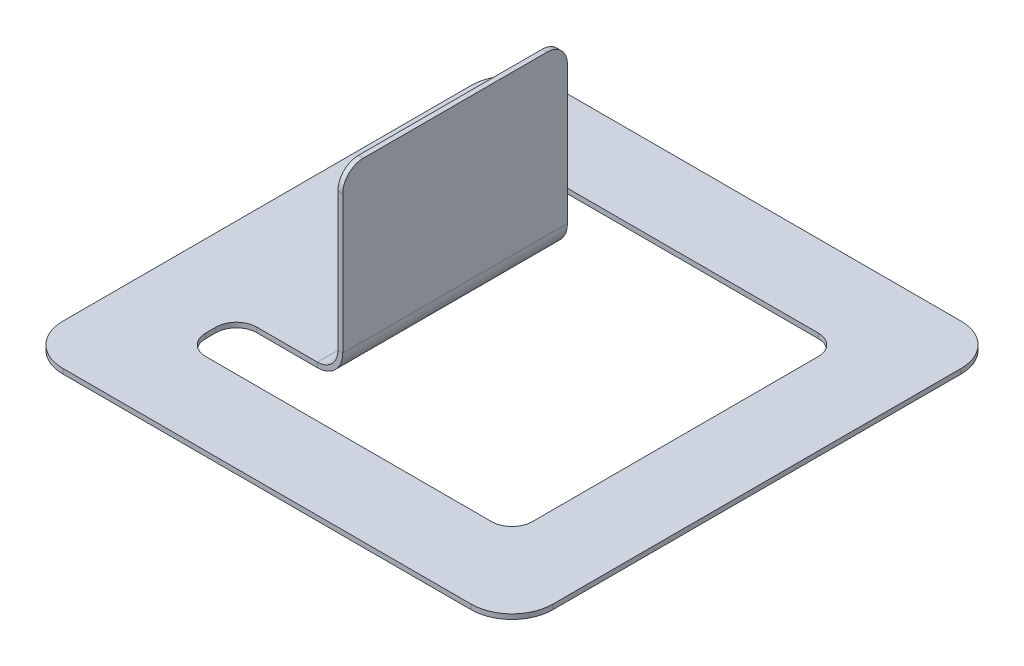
ISO-10303-21;
HEADER;
FILE_DESCRIPTION(('STEP AP214'),'2;1');
FILE_NAME('part.step','',(''),(''),'','','');
FILE_SCHEMA(('AUTOMOTIVE_DESIGN { 1 0 10303 214 1 1 1 1 }'));
ENDSEC;
DATA;
#1=APPLICATION_CONTEXT('core data for automotive mechanical design processes');
#2=APPLICATION_PROTOCOL_DEFINITION('international standard','automotive_design',2000,#1);
#3=PRODUCT_CONTEXT('',#1,'mechanical');
#4=PRODUCT('Part','Part','',(#3));
#5=PRODUCT_RELATED_PRODUCT_CATEGORY('part','',(#4));
#6=PRODUCT_DEFINITION_FORMATION('','',#4);
#7=PRODUCT_DEFINITION_CONTEXT('part definition',#1,'design');
#8=PRODUCT_DEFINITION('design','',#6,#7);
#9=PRODUCT_DEFINITION_SHAPE('','',#8);
#10=(LENGTH_UNIT() NAMED_UNIT(*) SI_UNIT(.MILLI.,.METRE.));
#11=(NAMED_UNIT(*) PLANE_ANGLE_UNIT() SI_UNIT($,.RADIAN.));
#12=(NAMED_UNIT(*) SI_UNIT($,.STERADIAN.) SOLID_ANGLE_UNIT());
#13=UNCERTAINTY_MEASURE_WITH_UNIT(LENGTH_MEASURE(1.E-05),#10,'distance_accuracy_value','');
#14=(GEOMETRIC_REPRESENTATION_CONTEXT(3) GLOBAL_UNCERTAINTY_ASSIGNED_CONTEXT((#13)) GLOBAL_UNIT_ASSIGNED_CONTEXT((#10,
#11,#12)) REPRESENTATION_CONTEXT('',''));
#15=CARTESIAN_POINT('',(0.,0.,0.));
#16=DIRECTION('',(0.,0.,1.));
#17=DIRECTION('',(1.,0.,0.));
#18=AXIS2_PLACEMENT_3D('',#15,#16,#17);
#19=CARTESIAN_POINT('',(-19.22749174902,85.7799882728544,-63.5));
#20=DIRECTION('',(1.,0.,0.));
#21=DIRECTION('',(0.,0.,-1.));
#22=AXIS2_PLACEMENT_3D('',#19,#20,#21);
#23=PLANE('',#22);
#24=DIRECTION('',(0.,1.,0.));
#25=VECTOR('',#24,1.);
#26=CARTESIAN_POINT('',(-19.2274917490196,-22.1700117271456,-34.9250000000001));
#27=LINE('',#26,#25);
#28=CARTESIAN_POINT('',(-19.2274917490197,7.87400000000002,-34.9250000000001));
#29=VERTEX_POINT('',#28);
#30=CARTESIAN_POINT('',(-19.2274917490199,50.8549882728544,-34.9250000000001));
#31=VERTEX_POINT('',#30);
#32=EDGE_CURVE('E36',#29,#31,#27,.T.);
#33=ORIENTED_EDGE('',*,*,#32,.F.);
#34=DIRECTION('',(0.,0.,1.));
#35=VECTOR('',#34,1.);
#36=CARTESIAN_POINT('',(-19.2274917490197,7.87400000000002,-63.5));
#37=LINE('',#36,#35);
#38=CARTESIAN_POINT('',(-19.2274917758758,7.87400000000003,34.925));
#39=VERTEX_POINT('',#38);
#40=EDGE_CURVE('E398',#29,#39,#37,.T.);
#41=ORIENTED_EDGE('',*,*,#40,.T.);
#42=DIRECTION('',(0.,-1.,0.));
#43=VECTOR('',#42,1.);
#44=CARTESIAN_POINT('',(-19.2274917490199,50.8549882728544,34.925));
#45=LINE('',#44,#43);
#46=CARTESIAN_POINT('',(-19.2274917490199,50.8549882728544,34.925));
#47=VERTEX_POINT('',#46);
#48=EDGE_CURVE('E382',#47,#39,#45,.T.);
#49=ORIENTED_EDGE('',*,*,#48,.F.);
#50=CARTESIAN_POINT('',(-19.2274917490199,50.8549882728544,28.575));
#51=DIRECTION('',(1.,0.,0.));
#52=DIRECTION('',(0.,0.,-1.));
#53=AXIS2_PLACEMENT_3D('',#50,#51,#52);
#54=CIRCLE('',#53,6.35);
#55=CARTESIAN_POINT('',(-19.2274917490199,57.2049882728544,28.575));
#56=VERTEX_POINT('',#55);
#57=EDGE_CURVE('E380',#56,#47,#54,.T.);
#58=ORIENTED_EDGE('',*,*,#57,.F.);
#59=DIRECTION('',(0.,0.,1.));
#60=VECTOR('',#59,1.);
#61=CARTESIAN_POINT('',(-19.2274917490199,57.2049882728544,-28.575));
#62=LINE('',#61,#60);
#63=CARTESIAN_POINT('',(-19.2274917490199,57.2049882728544,-28.575));
#64=VERTEX_POINT('',#63);
#65=EDGE_CURVE('E386',#64,#56,#62,.T.);
#66=ORIENTED_EDGE('',*,*,#65,.F.);
#67=CARTESIAN_POINT('',(-19.2274917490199,50.8549882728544,-28.5750000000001));
#68=DIRECTION('',(1.,0.,0.));
#69=DIRECTION('',(0.,0.,-1.));
#70=AXIS2_PLACEMENT_3D('',#67,#68,#69);
#71=CIRCLE('',#70,6.35);
#72=EDGE_CURVE('E383',#31,#64,#71,.T.);
#73=ORIENTED_EDGE('',*,*,#72,.F.);
#74=EDGE_LOOP('',(#33,#41,#49,#58,#66,#73));
#75=FACE_BOUND('',#74,.T.);
#76=ADVANCED_FACE('F32',(#75),#23,.F.);
#77=CARTESIAN_POINT('',(-17.70349174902,85.7799882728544,-63.5));
#78=DIRECTION('',(1.,0.,0.));
#79=DIRECTION('',(0.,0.,-1.));
#80=AXIS2_PLACEMENT_3D('',#77,#78,#79);
#81=PLANE('',#80);
#82=DIRECTION('',(0.,0.,1.));
#83=VECTOR('',#82,1.);
#84=CARTESIAN_POINT('',(-17.7034917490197,7.87400000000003,-63.5));
#85=LINE('',#84,#83);
#86=CARTESIAN_POINT('',(-17.7034917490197,7.87400000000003,-34.9250000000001));
#87=VERTEX_POINT('',#86);
#88=CARTESIAN_POINT('',(-17.7034917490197,7.87400000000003,34.925));
#89=VERTEX_POINT('',#88);
#90=EDGE_CURVE('E41',#87,#89,#85,.T.);
#91=ORIENTED_EDGE('',*,*,#90,.F.);
#92=DIRECTION('',(0.,1.,0.));
#93=VECTOR('',#92,1.);
#94=CARTESIAN_POINT('',(-17.7034917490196,-22.1700117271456,-34.9250000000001));
#95=LINE('',#94,#93);
#96=CARTESIAN_POINT('',(-17.7034917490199,50.8549882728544,-34.9250000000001));
#97=VERTEX_POINT('',#96);
#98=EDGE_CURVE('E57',#87,#97,#95,.T.);
#99=ORIENTED_EDGE('',*,*,#98,.T.);
#100=CARTESIAN_POINT('',(-17.7034917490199,50.8549882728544,-28.5750000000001));
#101=DIRECTION('',(1.,0.,0.));
#102=DIRECTION('',(0.,0.,-1.));
#103=AXIS2_PLACEMENT_3D('',#100,#101,#102);
#104=CIRCLE('',#103,6.35);
#105=CARTESIAN_POINT('',(-17.7034917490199,57.2049882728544,-28.575));
#106=VERTEX_POINT('',#105);
#107=EDGE_CURVE('E374',#97,#106,#104,.T.);
#108=ORIENTED_EDGE('',*,*,#107,.T.);
#109=DIRECTION('',(0.,0.,1.));
#110=VECTOR('',#109,1.);
#111=CARTESIAN_POINT('',(-17.7034917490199,57.2049882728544,-28.575));
#112=LINE('',#111,#110);
#113=CARTESIAN_POINT('',(-17.7034917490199,57.2049882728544,28.575));
#114=VERTEX_POINT('',#113);
#115=EDGE_CURVE('E377',#106,#114,#112,.T.);
#116=ORIENTED_EDGE('',*,*,#115,.T.);
#117=CARTESIAN_POINT('',(-17.7034917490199,50.8549882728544,28.575));
#118=DIRECTION('',(1.,0.,0.));
#119=DIRECTION('',(0.,0.,-1.));
#120=AXIS2_PLACEMENT_3D('',#117,#118,#119);
#121=CIRCLE('',#120,6.35);
#122=CARTESIAN_POINT('',(-17.7034917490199,50.8549882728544,34.925));
#123=VERTEX_POINT('',#122);
#124=EDGE_CURVE('E372',#114,#123,#121,.T.);
#125=ORIENTED_EDGE('',*,*,#124,.T.);
#126=DIRECTION('',(0.,-1.,0.));
#127=VECTOR('',#126,1.);
#128=CARTESIAN_POINT('',(-17.7034917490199,50.8549882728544,34.925));
#129=LINE('',#128,#127);
#130=EDGE_CURVE('E49',#123,#89,#129,.T.);
#131=ORIENTED_EDGE('',*,*,#130,.T.);
#132=EDGE_LOOP('',(#91,#99,#108,#116,#125,#131));
#133=FACE_BOUND('',#132,.T.);
#134=ADVANCED_FACE('F406',(#133),#81,.T.);
#135=CARTESIAN_POINT('',(-19.2274917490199,50.8549882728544,28.575));
#136=DIRECTION('',(1.,0.,0.));
#137=DIRECTION('',(0.,0.,-1.));
#138=AXIS2_PLACEMENT_3D('',#135,#136,#137);
#139=CYLINDRICAL_SURFACE('',#138,6.35);
#140=ORIENTED_EDGE('',*,*,#124,.F.);
#141=DIRECTION('',(1.,0.,0.));
#142=VECTOR('',#141,1.);
#143=CARTESIAN_POINT('',(-19.2274917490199,57.2049882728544,28.575));
#144=LINE('',#143,#142);
#145=EDGE_CURVE('E388',#56,#114,#144,.T.);
#146=ORIENTED_EDGE('',*,*,#145,.F.);
#147=ORIENTED_EDGE('',*,*,#57,.T.);
#148=DIRECTION('',(1.,0.,0.));
#149=VECTOR('',#148,1.);
#150=CARTESIAN_POINT('',(-19.2274917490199,50.8549882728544,34.925));
#151=LINE('',#150,#149);
#152=EDGE_CURVE('E395',#47,#123,#151,.T.);
#153=ORIENTED_EDGE('',*,*,#152,.T.);
#154=EDGE_LOOP('',(#140,#146,#147,#153));
#155=FACE_BOUND('',#154,.T.);
#156=ADVANCED_FACE('F419',(#155),#139,.T.);
#157=CARTESIAN_POINT('',(-19.2274917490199,50.8549882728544,34.925));
#158=DIRECTION('',(0.,0.,1.));
#159=DIRECTION('',(0.,1.,0.));
#160=AXIS2_PLACEMENT_3D('',#157,#158,#159);
#161=PLANE('',#160);
#162=DIRECTION('',(-1.,0.,0.));
#163=VECTOR('',#162,1.);
#164=CARTESIAN_POINT('',(-19.2274917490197,7.87400000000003,34.925));
#165=LINE('',#164,#163);
#166=EDGE_CURVE('E12',#89,#39,#165,.T.);
#167=ORIENTED_EDGE('',*,*,#166,.F.);
#168=ORIENTED_EDGE('',*,*,#130,.F.);
#169=ORIENTED_EDGE('',*,*,#152,.F.);
#170=ORIENTED_EDGE('',*,*,#48,.T.);
#171=EDGE_LOOP('',(#167,#168,#169,#170));
#172=FACE_BOUND('',#171,.T.);
#173=ADVANCED_FACE('F34',(#172),#161,.T.);
#174=CARTESIAN_POINT('',(-19.2274917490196,-22.1700117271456,-34.9250000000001));
#175=DIRECTION('',(0.,0.,-1.));
#176=DIRECTION('',(0.,-1.,0.));
#177=AXIS2_PLACEMENT_3D('',#174,#175,#176);
#178=PLANE('',#177);
#179=DIRECTION('',(1.,0.,0.));
#180=VECTOR('',#179,1.);
#181=CARTESIAN_POINT('',(-19.2274917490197,7.87400000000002,-34.9250000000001));
#182=LINE('',#181,#180);
#183=EDGE_CURVE('E401',#29,#87,#182,.T.);
#184=ORIENTED_EDGE('',*,*,#183,.F.);
#185=ORIENTED_EDGE('',*,*,#32,.T.);
#186=DIRECTION('',(1.,0.,0.));
#187=VECTOR('',#186,1.);
#188=CARTESIAN_POINT('',(-19.2274917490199,50.8549882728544,-34.9250000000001));
#189=LINE('',#188,#187);
#190=EDGE_CURVE('E393',#31,#97,#189,.T.);
#191=ORIENTED_EDGE('',*,*,#190,.T.);
#192=ORIENTED_EDGE('',*,*,#98,.F.);
#193=EDGE_LOOP('',(#184,#185,#191,#192));
#194=FACE_BOUND('',#193,.T.);
#195=ADVANCED_FACE('F409',(#194),#178,.T.);
#196=CARTESIAN_POINT('',(-19.2274917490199,50.8549882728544,-28.5750000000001));
#197=DIRECTION('',(1.,0.,0.));
#198=DIRECTION('',(0.,0.,-1.));
#199=AXIS2_PLACEMENT_3D('',#196,#197,#198);
#200=CYLINDRICAL_SURFACE('',#199,6.35);
#201=ORIENTED_EDGE('',*,*,#107,.F.);
#202=ORIENTED_EDGE('',*,*,#190,.F.);
#203=ORIENTED_EDGE('',*,*,#72,.T.);
#204=DIRECTION('',(1.,0.,0.));
#205=VECTOR('',#204,1.);
#206=CARTESIAN_POINT('',(-19.2274917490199,57.2049882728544,-28.575));
#207=LINE('',#206,#205);
#208=EDGE_CURVE('E391',#64,#106,#207,.T.);
#209=ORIENTED_EDGE('',*,*,#208,.T.);
#210=EDGE_LOOP('',(#201,#202,#203,#209));
#211=FACE_BOUND('',#210,.T.);
#212=ADVANCED_FACE('F412',(#211),#200,.T.);
#213=CARTESIAN_POINT('',(-19.2274917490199,57.2049882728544,-28.575));
#214=DIRECTION('',(0.,1.,0.));
#215=DIRECTION('',(0.,0.,-1.));
#216=AXIS2_PLACEMENT_3D('',#213,#214,#215);
#217=PLANE('',#216);
#218=ORIENTED_EDGE('',*,*,#115,.F.);
#219=ORIENTED_EDGE('',*,*,#208,.F.);
#220=ORIENTED_EDGE('',*,*,#65,.T.);
#221=ORIENTED_EDGE('',*,*,#145,.T.);
#222=EDGE_LOOP('',(#218,#219,#220,#221));
#223=FACE_BOUND('',#222,.T.);
#224=ADVANCED_FACE('F416',(#223),#217,.T.);
#225=CARTESIAN_POINT('',(76.2,1.524,-63.5));
#226=DIRECTION('',(-1.,0.,0.));
#227=DIRECTION('',(0.,0.,1.));
#228=AXIS2_PLACEMENT_3D('',#225,#226,#227);
#229=PLANE('',#228);
#230=DIRECTION('',(0.,0.,-1.));
#231=VECTOR('',#230,1.);
#232=CARTESIAN_POINT('',(76.2,0.,-63.5));
#233=LINE('',#232,#231);
#234=CARTESIAN_POINT('',(76.2,0.,63.5));
#235=VERTEX_POINT('',#234);
#236=CARTESIAN_POINT('',(76.2,0.,-63.5));
#237=VERTEX_POINT('',#236);
#238=EDGE_CURVE('E368',#235,#237,#233,.T.);
#239=ORIENTED_EDGE('',*,*,#238,.T.);
#240=DIRECTION('',(0.,-1.,0.));
#241=VECTOR('',#240,1.);
#242=CARTESIAN_POINT('',(76.2,1.524,-63.5));
#243=LINE('',#242,#241);
#244=CARTESIAN_POINT('',(76.2,1.524,-63.5));
#245=VERTEX_POINT('',#244);
#246=EDGE_CURVE('E329',#245,#237,#243,.T.);
#247=ORIENTED_EDGE('',*,*,#246,.F.);
#248=DIRECTION('',(0.,0.,-1.));
#249=VECTOR('',#248,1.);
#250=CARTESIAN_POINT('',(76.2,1.524,-63.5));
#251=LINE('',#250,#249);
#252=CARTESIAN_POINT('',(76.2,1.524,63.5));
#253=VERTEX_POINT('',#252);
#254=EDGE_CURVE('E268',#253,#245,#251,.T.);
#255=ORIENTED_EDGE('',*,*,#254,.F.);
#256=DIRECTION('',(0.,-1.,0.));
#257=VECTOR('',#256,1.);
#258=CARTESIAN_POINT('',(76.2,1.524,63.5));
#259=LINE('',#258,#257);
#260=EDGE_CURVE('E365',#253,#235,#259,.T.);
#261=ORIENTED_EDGE('',*,*,#260,.T.);
#262=EDGE_LOOP('',(#239,#247,#255,#261));
#263=FACE_BOUND('',#262,.T.);
#264=ADVANCED_FACE('F565',(#263),#229,.F.);
#265=CARTESIAN_POINT('',(63.5,1.524,63.5));
#266=DIRECTION('',(0.,-1.,0.));
#267=DIRECTION('',(0.,0.,-1.));
#268=AXIS2_PLACEMENT_3D('',#265,#266,#267);
#269=CYLINDRICAL_SURFACE('',#268,12.7);
#270=CARTESIAN_POINT('',(63.5,0.,63.5));
#271=DIRECTION('',(0.,1.,0.));
#272=DIRECTION('',(0.,0.,1.));
#273=AXIS2_PLACEMENT_3D('',#270,#271,#272);
#274=CIRCLE('',#273,12.7);
#275=CARTESIAN_POINT('',(63.5,0.,76.2));
#276=VERTEX_POINT('',#275);
#277=EDGE_CURVE('E363',#276,#235,#274,.T.);
#278=ORIENTED_EDGE('',*,*,#277,.T.);
#279=ORIENTED_EDGE('',*,*,#260,.F.);
#280=CARTESIAN_POINT('',(63.5,1.524,63.5));
#281=DIRECTION('',(0.,1.,0.));
#282=DIRECTION('',(0.,0.,1.));
#283=AXIS2_PLACEMENT_3D('',#280,#281,#282);
#284=CIRCLE('',#283,12.7);
#285=CARTESIAN_POINT('',(63.5,1.524,76.2));
#286=VERTEX_POINT('',#285);
#287=EDGE_CURVE('E270',#286,#253,#284,.T.);
#288=ORIENTED_EDGE('',*,*,#287,.F.);
#289=DIRECTION('',(0.,-1.,0.));
#290=VECTOR('',#289,1.);
#291=CARTESIAN_POINT('',(63.5,1.524,76.2));
#292=LINE('',#291,#290);
#293=EDGE_CURVE('E360',#286,#276,#292,.T.);
#294=ORIENTED_EDGE('',*,*,#293,.T.);
#295=EDGE_LOOP('',(#278,#279,#288,#294));
#296=FACE_BOUND('',#295,.T.);
#297=ADVANCED_FACE('F561',(#296),#269,.T.);
#298=CARTESIAN_POINT('',(-63.5,1.524,76.2));
#299=DIRECTION('',(0.,0.,-1.));
#300=DIRECTION('',(-1.,0.,0.));
#301=AXIS2_PLACEMENT_3D('',#298,#299,#300);
#302=PLANE('',#301);
#303=DIRECTION('',(1.,0.,0.));
#304=VECTOR('',#303,1.);
#305=CARTESIAN_POINT('',(-63.5,0.,76.2));
#306=LINE('',#305,#304);
#307=CARTESIAN_POINT('',(-63.5,0.,76.2));
#308=VERTEX_POINT('',#307);
#309=EDGE_CURVE('E358',#308,#276,#306,.T.);
#310=ORIENTED_EDGE('',*,*,#309,.T.);
#311=ORIENTED_EDGE('',*,*,#293,.F.);
#312=DIRECTION('',(1.,0.,0.));
#313=VECTOR('',#312,1.);
#314=CARTESIAN_POINT('',(-63.5,1.524,76.2));
#315=LINE('',#314,#313);
#316=CARTESIAN_POINT('',(-63.5,1.524,76.2));
#317=VERTEX_POINT('',#316);
#318=EDGE_CURVE('E272',#317,#286,#315,.T.);
#319=ORIENTED_EDGE('',*,*,#318,.F.);
#320=DIRECTION('',(0.,-1.,0.));
#321=VECTOR('',#320,1.);
#322=CARTESIAN_POINT('',(-63.5,1.524,76.2));
#323=LINE('',#322,#321);
#324=EDGE_CURVE('E355',#317,#308,#323,.T.);
#325=ORIENTED_EDGE('',*,*,#324,.T.);
#326=EDGE_LOOP('',(#310,#311,#319,#325));
#327=FACE_BOUND('',#326,.T.);
#328=ADVANCED_FACE('F557',(#327),#302,.F.);
#329=CARTESIAN_POINT('',(-63.5,1.524,63.5));
#330=DIRECTION('',(0.,-1.,0.));
#331=DIRECTION('',(0.,0.,-1.));
#332=AXIS2_PLACEMENT_3D('',#329,#330,#331);
#333=CYLINDRICAL_SURFACE('',#332,12.7);
#334=CARTESIAN_POINT('',(-63.5,0.,63.5));
#335=DIRECTION('',(0.,1.,0.));
#336=DIRECTION('',(0.,0.,1.));
#337=AXIS2_PLACEMENT_3D('',#334,#335,#336);
#338=CIRCLE('',#337,12.7);
#339=CARTESIAN_POINT('',(-76.2,0.,63.5));
#340=VERTEX_POINT('',#339);
#341=EDGE_CURVE('E353',#340,#308,#338,.T.);
#342=ORIENTED_EDGE('',*,*,#341,.T.);
#343=ORIENTED_EDGE('',*,*,#324,.F.);
#344=CARTESIAN_POINT('',(-63.5,1.524,63.5));
#345=DIRECTION('',(0.,1.,0.));
#346=DIRECTION('',(0.,0.,1.));
#347=AXIS2_PLACEMENT_3D('',#344,#345,#346);
#348=CIRCLE('',#347,12.7);
#349=CARTESIAN_POINT('',(-76.2,1.524,63.5));
#350=VERTEX_POINT('',#349);
#351=EDGE_CURVE('E274',#350,#317,#348,.T.);
#352=ORIENTED_EDGE('',*,*,#351,.F.);
#353=DIRECTION('',(0.,-1.,0.));
#354=VECTOR('',#353,1.);
#355=CARTESIAN_POINT('',(-76.2,1.524,63.5));
#356=LINE('',#355,#354);
#357=EDGE_CURVE('E350',#350,#340,#356,.T.);
#358=ORIENTED_EDGE('',*,*,#357,.T.);
#359=EDGE_LOOP('',(#342,#343,#352,#358));
#360=FACE_BOUND('',#359,.T.);
#361=ADVANCED_FACE('F552',(#360),#333,.T.);
#362=CARTESIAN_POINT('',(-76.2,1.524,-63.5));
#363=DIRECTION('',(1.,0.,0.));
#364=DIRECTION('',(0.,0.,-1.));
#365=AXIS2_PLACEMENT_3D('',#362,#363,#364);
#366=PLANE('',#365);
#367=DIRECTION('',(0.,0.,1.));
#368=VECTOR('',#367,1.);
#369=CARTESIAN_POINT('',(-76.2,0.,-63.5));
#370=LINE('',#369,#368);
#371=CARTESIAN_POINT('',(-76.2,0.,-63.5));
#372=VERTEX_POINT('',#371);
#373=EDGE_CURVE('E348',#372,#340,#370,.T.);
#374=ORIENTED_EDGE('',*,*,#373,.T.);
#375=ORIENTED_EDGE('',*,*,#357,.F.);
#376=DIRECTION('',(0.,0.,1.));
#377=VECTOR('',#376,1.);
#378=CARTESIAN_POINT('',(-76.2,1.524,-63.5));
#379=LINE('',#378,#377);
#380=CARTESIAN_POINT('',(-76.2,1.524,-63.5));
#381=VERTEX_POINT('',#380);
#382=EDGE_CURVE('E276',#381,#350,#379,.T.);
#383=ORIENTED_EDGE('',*,*,#382,.F.);
#384=DIRECTION('',(0.,-1.,0.));
#385=VECTOR('',#384,1.);
#386=CARTESIAN_POINT('',(-76.2,1.524,-63.5));
#387=LINE('',#386,#385);
#388=EDGE_CURVE('E345',#381,#372,#387,.T.);
#389=ORIENTED_EDGE('',*,*,#388,.T.);
#390=EDGE_LOOP('',(#374,#375,#383,#389));
#391=FACE_BOUND('',#390,.T.);
#392=ADVANCED_FACE('F548',(#391),#366,.F.);
#393=CARTESIAN_POINT('',(-63.5,1.524,-63.5));
#394=DIRECTION('',(0.,-1.,0.));
#395=DIRECTION('',(0.,0.,-1.));
#396=AXIS2_PLACEMENT_3D('',#393,#394,#395);
#397=CYLINDRICAL_SURFACE('',#396,12.7);
#398=CARTESIAN_POINT('',(-63.5,0.,-63.5));
#399=DIRECTION('',(0.,1.,0.));
#400=DIRECTION('',(0.,0.,1.));
#401=AXIS2_PLACEMENT_3D('',#398,#399,#400);
#402=CIRCLE('',#401,12.7);
#403=CARTESIAN_POINT('',(-63.5,0.,-76.2));
#404=VERTEX_POINT('',#403);
#405=EDGE_CURVE('E343',#404,#372,#402,.T.);
#406=ORIENTED_EDGE('',*,*,#405,.T.);
#407=ORIENTED_EDGE('',*,*,#388,.F.);
#408=CARTESIAN_POINT('',(-63.5,1.524,-63.5));
#409=DIRECTION('',(0.,1.,0.));
#410=DIRECTION('',(0.,0.,1.));
#411=AXIS2_PLACEMENT_3D('',#408,#409,#410);
#412=CIRCLE('',#411,12.7);
#413=CARTESIAN_POINT('',(-63.5,1.524,-76.2));
#414=VERTEX_POINT('',#413);
#415=EDGE_CURVE('E278',#414,#381,#412,.T.);
#416=ORIENTED_EDGE('',*,*,#415,.F.);
#417=DIRECTION('',(0.,-1.,0.));
#418=VECTOR('',#417,1.);
#419=CARTESIAN_POINT('',(-63.5,1.524,-76.2));
#420=LINE('',#419,#418);
#421=EDGE_CURVE('E340',#414,#404,#420,.T.);
#422=ORIENTED_EDGE('',*,*,#421,.T.);
#423=EDGE_LOOP('',(#406,#407,#416,#422));
#424=FACE_BOUND('',#423,.T.);
#425=ADVANCED_FACE('F542',(#424),#397,.T.);
#426=CARTESIAN_POINT('',(-63.5,1.524,-76.2));
#427=DIRECTION('',(0.,0.,1.));
#428=DIRECTION('',(1.,0.,0.));
#429=AXIS2_PLACEMENT_3D('',#426,#427,#428);
#430=PLANE('',#429);
#431=DIRECTION('',(-1.,0.,0.));
#432=VECTOR('',#431,1.);
#433=CARTESIAN_POINT('',(-63.5,0.,-76.2));
#434=LINE('',#433,#432);
#435=CARTESIAN_POINT('',(63.5,0.,-76.2));
#436=VERTEX_POINT('',#435);
#437=EDGE_CURVE('E338',#436,#404,#434,.T.);
#438=ORIENTED_EDGE('',*,*,#437,.T.);
#439=ORIENTED_EDGE('',*,*,#421,.F.);
#440=DIRECTION('',(-1.,0.,0.));
#441=VECTOR('',#440,1.);
#442=CARTESIAN_POINT('',(-63.5,1.524,-76.2));
#443=LINE('',#442,#441);
#444=CARTESIAN_POINT('',(63.5,1.524,-76.2));
#445=VERTEX_POINT('',#444);
#446=EDGE_CURVE('E280',#445,#414,#443,.T.);
#447=ORIENTED_EDGE('',*,*,#446,.F.);
#448=DIRECTION('',(0.,-1.,0.));
#449=VECTOR('',#448,1.);
#450=CARTESIAN_POINT('',(63.5,1.524,-76.2));
#451=LINE('',#450,#449);
#452=EDGE_CURVE('E335',#445,#436,#451,.T.);
#453=ORIENTED_EDGE('',*,*,#452,.T.);
#454=EDGE_LOOP('',(#438,#439,#447,#453));
#455=FACE_BOUND('',#454,.T.);
#456=ADVANCED_FACE('F537',(#455),#430,.F.);
#457=CARTESIAN_POINT('',(63.5,1.524,-63.5));
#458=DIRECTION('',(0.,-1.,0.));
#459=DIRECTION('',(0.,0.,-1.));
#460=AXIS2_PLACEMENT_3D('',#457,#458,#459);
#461=CYLINDRICAL_SURFACE('',#460,12.7);
#462=CARTESIAN_POINT('',(63.5,0.,-63.5));
#463=DIRECTION('',(0.,1.,0.));
#464=DIRECTION('',(0.,0.,-1.));
#465=AXIS2_PLACEMENT_3D('',#462,#463,#464);
#466=CIRCLE('',#465,12.7);
#467=EDGE_CURVE('E332',#237,#436,#466,.T.);
#468=ORIENTED_EDGE('',*,*,#467,.T.);
#469=ORIENTED_EDGE('',*,*,#452,.F.);
#470=CARTESIAN_POINT('',(63.5,1.524,-63.5));
#471=DIRECTION('',(0.,1.,0.));
#472=DIRECTION('',(0.,0.,-1.));
#473=AXIS2_PLACEMENT_3D('',#470,#471,#472);
#474=CIRCLE('',#473,12.7);
#475=EDGE_CURVE('E282',#245,#445,#474,.T.);
#476=ORIENTED_EDGE('',*,*,#475,.F.);
#477=ORIENTED_EDGE('',*,*,#246,.T.);
#478=EDGE_LOOP('',(#468,#469,#476,#477));
#479=FACE_BOUND('',#478,.T.);
#480=ADVANCED_FACE('F534',(#479),#461,.T.);
#481=CARTESIAN_POINT('',(-44.45,1.524,41.275));
#482=DIRECTION('',(0.,-1.,0.));
#483=DIRECTION('',(0.,0.,-1.));
#484=AXIS2_PLACEMENT_3D('',#481,#482,#483);
#485=CYLINDRICAL_SURFACE('',#484,6.35000000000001);
#486=CARTESIAN_POINT('',(-44.45,0.,41.275));
#487=DIRECTION('',(0.,1.,0.));
#488=DIRECTION('',(0.,0.,-1.));
#489=AXIS2_PLACEMENT_3D('',#486,#487,#488);
#490=CIRCLE('',#489,6.35000000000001);
#491=CARTESIAN_POINT('',(-44.45,0.,34.925));
#492=VERTEX_POINT('',#491);
#493=CARTESIAN_POINT('',(-50.8,0.,41.275));
#494=VERTEX_POINT('',#493);
#495=EDGE_CURVE('E252',#492,#494,#490,.T.);
#496=ORIENTED_EDGE('',*,*,#495,.F.);
#497=DIRECTION('',(0.,-1.,0.));
#498=VECTOR('',#497,1.);
#499=CARTESIAN_POINT('',(-44.45,1.524,34.925));
#500=LINE('',#499,#498);
#501=CARTESIAN_POINT('',(-44.45,1.524,34.925));
#502=VERTEX_POINT('',#501);
#503=EDGE_CURVE('E248',#502,#492,#500,.T.);
#504=ORIENTED_EDGE('',*,*,#503,.F.);
#505=CARTESIAN_POINT('',(-44.45,1.524,41.275));
#506=DIRECTION('',(0.,1.,0.));
#507=DIRECTION('',(0.,0.,-1.));
#508=AXIS2_PLACEMENT_3D('',#505,#506,#507);
#509=CIRCLE('',#508,6.35000000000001);
#510=CARTESIAN_POINT('',(-50.8,1.524,41.275));
#511=VERTEX_POINT('',#510);
#512=EDGE_CURVE('E327',#502,#511,#509,.T.);
#513=ORIENTED_EDGE('',*,*,#512,.T.);
#514=DIRECTION('',(0.,-1.,0.));
#515=VECTOR('',#514,1.);
#516=CARTESIAN_POINT('',(-50.8,1.524,41.275));
#517=LINE('',#516,#515);
#518=EDGE_CURVE('E325',#511,#494,#517,.T.);
#519=ORIENTED_EDGE('',*,*,#518,.T.);
#520=EDGE_LOOP('',(#496,#504,#513,#519));
#521=FACE_BOUND('',#520,.T.);
#522=ADVANCED_FACE('F465',(#521),#485,.F.);
#523=CARTESIAN_POINT('',(-50.8,1.524,41.275));
#524=DIRECTION('',(1.,0.,0.));
#525=DIRECTION('',(0.,0.,-1.));
#526=AXIS2_PLACEMENT_3D('',#523,#524,#525);
#527=PLANE('',#526);
#528=DIRECTION('',(0.,0.,1.));
#529=VECTOR('',#528,1.);
#530=CARTESIAN_POINT('',(-50.8,0.,41.275));
#531=LINE('',#530,#529);
#532=CARTESIAN_POINT('',(-50.7999999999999,0.,44.4500000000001));
#533=VERTEX_POINT('',#532);
#534=EDGE_CURVE('E461',#494,#533,#531,.T.);
#535=ORIENTED_EDGE('',*,*,#534,.F.);
#536=ORIENTED_EDGE('',*,*,#518,.F.);
#537=DIRECTION('',(0.,0.,1.));
#538=VECTOR('',#537,1.);
#539=CARTESIAN_POINT('',(-50.8,1.524,41.275));
#540=LINE('',#539,#538);
#541=CARTESIAN_POINT('',(-50.7999999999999,1.524,44.4500000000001));
#542=VERTEX_POINT('',#541);
#543=EDGE_CURVE('E323',#511,#542,#540,.T.);
#544=ORIENTED_EDGE('',*,*,#543,.T.);
#545=DIRECTION('',(0.,-1.,0.));
#546=VECTOR('',#545,1.);
#547=CARTESIAN_POINT('',(-50.7999999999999,1.524,44.4500000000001));
#548=LINE('',#547,#546);
#549=EDGE_CURVE('E321',#542,#533,#548,.T.);
#550=ORIENTED_EDGE('',*,*,#549,.T.);
#551=EDGE_LOOP('',(#535,#536,#544,#550));
#552=FACE_BOUND('',#551,.T.);
#553=ADVANCED_FACE('F470',(#552),#527,.T.);
#554=CARTESIAN_POINT('',(-44.4499999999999,1.524,44.4500000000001));
#555=DIRECTION('',(0.,-1.,0.));
#556=DIRECTION('',(0.,0.,-1.));
#557=AXIS2_PLACEMENT_3D('',#554,#555,#556);
#558=CYLINDRICAL_SURFACE('',#557,6.35);
#559=CARTESIAN_POINT('',(-44.4499999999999,0.,44.4500000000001));
#560=DIRECTION('',(0.,1.,0.));
#561=DIRECTION('',(0.,0.,1.));
#562=AXIS2_PLACEMENT_3D('',#559,#560,#561);
#563=CIRCLE('',#562,6.35);
#564=CARTESIAN_POINT('',(-44.4499999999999,0.,50.8000000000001));
#565=VERTEX_POINT('',#564);
#566=EDGE_CURVE('E458',#533,#565,#563,.T.);
#567=ORIENTED_EDGE('',*,*,#566,.F.);
#568=ORIENTED_EDGE('',*,*,#549,.F.);
#569=CARTESIAN_POINT('',(-44.4499999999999,1.524,44.4500000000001));
#570=DIRECTION('',(0.,1.,0.));
#571=DIRECTION('',(0.,0.,1.));
#572=AXIS2_PLACEMENT_3D('',#569,#570,#571);
#573=CIRCLE('',#572,6.35);
#574=CARTESIAN_POINT('',(-44.4499999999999,1.524,50.8000000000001));
#575=VERTEX_POINT('',#574);
#576=EDGE_CURVE('E319',#542,#575,#573,.T.);
#577=ORIENTED_EDGE('',*,*,#576,.T.);
#578=DIRECTION('',(0.,-1.,0.));
#579=VECTOR('',#578,1.);
#580=CARTESIAN_POINT('',(-44.4499999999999,1.524,50.8000000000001));
#581=LINE('',#580,#579);
#582=EDGE_CURVE('E317',#575,#565,#581,.T.);
#583=ORIENTED_EDGE('',*,*,#582,.T.);
#584=EDGE_LOOP('',(#567,#568,#577,#583));
#585=FACE_BOUND('',#584,.T.);
#586=ADVANCED_FACE('F475',(#585),#558,.F.);
#587=CARTESIAN_POINT('',(-44.4499999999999,1.524,50.8000000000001));
#588=DIRECTION('',(0.,0.,-1.));
#589=DIRECTION('',(-1.,0.,0.));
#590=AXIS2_PLACEMENT_3D('',#587,#588,#589);
#591=PLANE('',#590);
#592=DIRECTION('',(1.,0.,0.));
#593=VECTOR('',#592,1.);
#594=CARTESIAN_POINT('',(-44.4499999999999,0.,50.8000000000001));
#595=LINE('',#594,#593);
#596=CARTESIAN_POINT('',(44.4500000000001,0.,50.8000000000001));
#597=VERTEX_POINT('',#596);
#598=EDGE_CURVE('E455',#565,#597,#595,.T.);
#599=ORIENTED_EDGE('',*,*,#598,.F.);
#600=ORIENTED_EDGE('',*,*,#582,.F.);
#601=DIRECTION('',(1.,0.,0.));
#602=VECTOR('',#601,1.);
#603=CARTESIAN_POINT('',(-44.4499999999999,1.524,50.8000000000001));
#604=LINE('',#603,#602);
#605=CARTESIAN_POINT('',(44.4500000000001,1.524,50.8000000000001));
#606=VERTEX_POINT('',#605);
#607=EDGE_CURVE('E315',#575,#606,#604,.T.);
#608=ORIENTED_EDGE('',*,*,#607,.T.);
#609=DIRECTION('',(0.,-1.,0.));
#610=VECTOR('',#609,1.);
#611=CARTESIAN_POINT('',(44.4500000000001,1.524,50.8000000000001));
#612=LINE('',#611,#610);
#613=EDGE_CURVE('E313',#606,#597,#612,.T.);
#614=ORIENTED_EDGE('',*,*,#613,.T.);
#615=EDGE_LOOP('',(#599,#600,#608,#614));
#616=FACE_BOUND('',#615,.T.);
#617=ADVANCED_FACE('F480',(#616),#591,.T.);
#618=CARTESIAN_POINT('',(44.4500000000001,1.524,44.4500000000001));
#619=DIRECTION('',(0.,-1.,0.));
#620=DIRECTION('',(0.,0.,-1.));
#621=AXIS2_PLACEMENT_3D('',#618,#619,#620);
#622=CYLINDRICAL_SURFACE('',#621,6.35);
#623=CARTESIAN_POINT('',(44.4500000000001,0.,44.4500000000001));
#624=DIRECTION('',(0.,1.,0.));
#625=DIRECTION('',(0.,0.,-1.));
#626=AXIS2_PLACEMENT_3D('',#623,#624,#625);
#627=CIRCLE('',#626,6.35);
#628=CARTESIAN_POINT('',(50.8000000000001,0.,44.4500000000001));
#629=VERTEX_POINT('',#628);
#630=EDGE_CURVE('E452',#597,#629,#627,.T.);
#631=ORIENTED_EDGE('',*,*,#630,.F.);
#632=ORIENTED_EDGE('',*,*,#613,.F.);
#633=CARTESIAN_POINT('',(44.4500000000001,1.524,44.4500000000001));
#634=DIRECTION('',(0.,1.,0.));
#635=DIRECTION('',(0.,0.,-1.));
#636=AXIS2_PLACEMENT_3D('',#633,#634,#635);
#637=CIRCLE('',#636,6.35);
#638=CARTESIAN_POINT('',(50.8000000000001,1.524,44.4500000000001));
#639=VERTEX_POINT('',#638);
#640=EDGE_CURVE('E311',#606,#639,#637,.T.);
#641=ORIENTED_EDGE('',*,*,#640,.T.);
#642=DIRECTION('',(0.,-1.,0.));
#643=VECTOR('',#642,1.);
#644=CARTESIAN_POINT('',(50.8000000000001,1.524,44.4500000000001));
#645=LINE('',#644,#643);
#646=EDGE_CURVE('E309',#639,#629,#645,.T.);
#647=ORIENTED_EDGE('',*,*,#646,.T.);
#648=EDGE_LOOP('',(#631,#632,#641,#647));
#649=FACE_BOUND('',#648,.T.);
#650=ADVANCED_FACE('F485',(#649),#622,.F.);
#651=CARTESIAN_POINT('',(50.8000000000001,1.524,-44.4499999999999));
#652=DIRECTION('',(-1.,0.,0.));
#653=DIRECTION('',(0.,0.,1.));
#654=AXIS2_PLACEMENT_3D('',#651,#652,#653);
#655=PLANE('',#654);
#656=DIRECTION('',(0.,0.,-1.));
#657=VECTOR('',#656,1.);
#658=CARTESIAN_POINT('',(50.8000000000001,0.,-44.4499999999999));
#659=LINE('',#658,#657);
#660=CARTESIAN_POINT('',(50.8000000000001,0.,-44.4499999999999));
#661=VERTEX_POINT('',#660);
#662=EDGE_CURVE('E449',#629,#661,#659,.T.);
#663=ORIENTED_EDGE('',*,*,#662,.F.);
#664=ORIENTED_EDGE('',*,*,#646,.F.);
#665=DIRECTION('',(0.,0.,-1.));
#666=VECTOR('',#665,1.);
#667=CARTESIAN_POINT('',(50.8000000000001,1.524,-44.4499999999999));
#668=LINE('',#667,#666);
#669=CARTESIAN_POINT('',(50.8000000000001,1.524,-44.4499999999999));
#670=VERTEX_POINT('',#669);
#671=EDGE_CURVE('E307',#639,#670,#668,.T.);
#672=ORIENTED_EDGE('',*,*,#671,.T.);
#673=DIRECTION('',(0.,-1.,0.));
#674=VECTOR('',#673,1.);
#675=CARTESIAN_POINT('',(50.8000000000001,1.524,-44.4499999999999));
#676=LINE('',#675,#674);
#677=EDGE_CURVE('E305',#670,#661,#676,.T.);
#678=ORIENTED_EDGE('',*,*,#677,.T.);
#679=EDGE_LOOP('',(#663,#664,#672,#678));
#680=FACE_BOUND('',#679,.T.);
#681=ADVANCED_FACE('F490',(#680),#655,.T.);
#682=CARTESIAN_POINT('',(44.4500000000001,1.524,-44.4499999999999));
#683=DIRECTION('',(0.,-1.,0.));
#684=DIRECTION('',(0.,0.,-1.));
#685=AXIS2_PLACEMENT_3D('',#682,#683,#684);
#686=CYLINDRICAL_SURFACE('',#685,6.35);
#687=CARTESIAN_POINT('',(44.4500000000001,0.,-44.4499999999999));
#688=DIRECTION('',(0.,1.,0.));
#689=DIRECTION('',(0.,0.,-1.));
#690=AXIS2_PLACEMENT_3D('',#687,#688,#689);
#691=CIRCLE('',#690,6.35);
#692=CARTESIAN_POINT('',(44.4500000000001,0.,-50.7999999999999));
#693=VERTEX_POINT('',#692);
#694=EDGE_CURVE('E446',#661,#693,#691,.T.);
#695=ORIENTED_EDGE('',*,*,#694,.F.);
#696=ORIENTED_EDGE('',*,*,#677,.F.);
#697=CARTESIAN_POINT('',(44.4500000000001,1.524,-44.4499999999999));
#698=DIRECTION('',(0.,1.,0.));
#699=DIRECTION('',(0.,0.,-1.));
#700=AXIS2_PLACEMENT_3D('',#697,#698,#699);
#701=CIRCLE('',#700,6.35);
#702=CARTESIAN_POINT('',(44.4500000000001,1.524,-50.7999999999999));
#703=VERTEX_POINT('',#702);
#704=EDGE_CURVE('E303',#670,#703,#701,.T.);
#705=ORIENTED_EDGE('',*,*,#704,.T.);
#706=DIRECTION('',(0.,-1.,0.));
#707=VECTOR('',#706,1.);
#708=CARTESIAN_POINT('',(44.4500000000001,1.524,-50.7999999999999));
#709=LINE('',#708,#707);
#710=EDGE_CURVE('E301',#703,#693,#709,.T.);
#711=ORIENTED_EDGE('',*,*,#710,.T.);
#712=EDGE_LOOP('',(#695,#696,#705,#711));
#713=FACE_BOUND('',#712,.T.);
#714=ADVANCED_FACE('F495',(#713),#686,.F.);
#715=CARTESIAN_POINT('',(-44.4499999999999,1.524,-50.7999999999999));
#716=DIRECTION('',(0.,0.,1.));
#717=DIRECTION('',(1.,0.,0.));
#718=AXIS2_PLACEMENT_3D('',#715,#716,#717);
#719=PLANE('',#718);
#720=DIRECTION('',(-1.,0.,0.));
#721=VECTOR('',#720,1.);
#722=CARTESIAN_POINT('',(-44.4499999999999,0.,-50.7999999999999));
#723=LINE('',#722,#721);
#724=CARTESIAN_POINT('',(-44.4499999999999,0.,-50.7999999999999));
#725=VERTEX_POINT('',#724);
#726=EDGE_CURVE('E443',#693,#725,#723,.T.);
#727=ORIENTED_EDGE('',*,*,#726,.F.);
#728=ORIENTED_EDGE('',*,*,#710,.F.);
#729=DIRECTION('',(-1.,0.,0.));
#730=VECTOR('',#729,1.);
#731=CARTESIAN_POINT('',(-44.4499999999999,1.524,-50.7999999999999));
#732=LINE('',#731,#730);
#733=CARTESIAN_POINT('',(-44.4499999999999,1.524,-50.7999999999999));
#734=VERTEX_POINT('',#733);
#735=EDGE_CURVE('E299',#703,#734,#732,.T.);
#736=ORIENTED_EDGE('',*,*,#735,.T.);
#737=DIRECTION('',(0.,-1.,0.));
#738=VECTOR('',#737,1.);
#739=CARTESIAN_POINT('',(-44.4499999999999,1.524,-50.7999999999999));
#740=LINE('',#739,#738);
#741=EDGE_CURVE('E297',#734,#725,#740,.T.);
#742=ORIENTED_EDGE('',*,*,#741,.T.);
#743=EDGE_LOOP('',(#727,#728,#736,#742));
#744=FACE_BOUND('',#743,.T.);
#745=ADVANCED_FACE('F500',(#744),#719,.T.);
#746=CARTESIAN_POINT('',(-44.4499999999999,1.524,-44.4499999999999));
#747=DIRECTION('',(0.,-1.,0.));
#748=DIRECTION('',(0.,0.,-1.));
#749=AXIS2_PLACEMENT_3D('',#746,#747,#748);
#750=CYLINDRICAL_SURFACE('',#749,6.35);
#751=CARTESIAN_POINT('',(-44.4499999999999,0.,-44.4499999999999));
#752=DIRECTION('',(0.,1.,0.));
#753=DIRECTION('',(0.,0.,1.));
#754=AXIS2_PLACEMENT_3D('',#751,#752,#753);
#755=CIRCLE('',#754,6.35);
#756=CARTESIAN_POINT('',(-50.7999999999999,0.,-44.4499999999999));
#757=VERTEX_POINT('',#756);
#758=EDGE_CURVE('E440',#725,#757,#755,.T.);
#759=ORIENTED_EDGE('',*,*,#758,.F.);
#760=ORIENTED_EDGE('',*,*,#741,.F.);
#761=CARTESIAN_POINT('',(-44.4499999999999,1.524,-44.4499999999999));
#762=DIRECTION('',(0.,1.,0.));
#763=DIRECTION('',(0.,0.,1.));
#764=AXIS2_PLACEMENT_3D('',#761,#762,#763);
#765=CIRCLE('',#764,6.35);
#766=CARTESIAN_POINT('',(-50.7999999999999,1.524,-44.4499999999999));
#767=VERTEX_POINT('',#766);
#768=EDGE_CURVE('E295',#734,#767,#765,.T.);
#769=ORIENTED_EDGE('',*,*,#768,.T.);
#770=DIRECTION('',(0.,-1.,0.));
#771=VECTOR('',#770,1.);
#772=CARTESIAN_POINT('',(-50.7999999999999,1.524,-44.4499999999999));
#773=LINE('',#772,#771);
#774=EDGE_CURVE('E293',#767,#757,#773,.T.);
#775=ORIENTED_EDGE('',*,*,#774,.T.);
#776=EDGE_LOOP('',(#759,#760,#769,#775));
#777=FACE_BOUND('',#776,.T.);
#778=ADVANCED_FACE('F505',(#777),#750,.F.);
#779=CARTESIAN_POINT('',(-50.7999999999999,1.524,-44.4499999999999));
#780=DIRECTION('',(1.,0.,0.));
#781=DIRECTION('',(0.,0.,-1.));
#782=AXIS2_PLACEMENT_3D('',#779,#780,#781);
#783=PLANE('',#782);
#784=DIRECTION('',(0.,0.,1.));
#785=VECTOR('',#784,1.);
#786=CARTESIAN_POINT('',(-50.7999999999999,0.,-44.4499999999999));
#787=LINE('',#786,#785);
#788=CARTESIAN_POINT('',(-50.8,0.,-41.2750000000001));
#789=VERTEX_POINT('',#788);
#790=EDGE_CURVE('E437',#757,#789,#787,.T.);
#791=ORIENTED_EDGE('',*,*,#790,.F.);
#792=ORIENTED_EDGE('',*,*,#774,.F.);
#793=DIRECTION('',(0.,0.,1.));
#794=VECTOR('',#793,1.);
#795=CARTESIAN_POINT('',(-50.7999999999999,1.524,-44.4499999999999));
#796=LINE('',#795,#794);
#797=CARTESIAN_POINT('',(-50.8,1.524,-41.2750000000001));
#798=VERTEX_POINT('',#797);
#799=EDGE_CURVE('E291',#767,#798,#796,.T.);
#800=ORIENTED_EDGE('',*,*,#799,.T.);
#801=DIRECTION('',(0.,-1.,0.));
#802=VECTOR('',#801,1.);
#803=CARTESIAN_POINT('',(-50.8,1.524,-41.2750000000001));
#804=LINE('',#803,#802);
#805=EDGE_CURVE('E289',#798,#789,#804,.T.);
#806=ORIENTED_EDGE('',*,*,#805,.T.);
#807=EDGE_LOOP('',(#791,#792,#800,#806));
#808=FACE_BOUND('',#807,.T.);
#809=ADVANCED_FACE('F510',(#808),#783,.T.);
#810=CARTESIAN_POINT('',(-44.45,1.524,-41.2750000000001));
#811=DIRECTION('',(0.,-1.,0.));
#812=DIRECTION('',(0.,0.,-1.));
#813=AXIS2_PLACEMENT_3D('',#810,#811,#812);
#814=CYLINDRICAL_SURFACE('',#813,6.35000000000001);
#815=CARTESIAN_POINT('',(-44.45,0.,-41.2750000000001));
#816=DIRECTION('',(0.,1.,0.));
#817=DIRECTION('',(0.,0.,-1.));
#818=AXIS2_PLACEMENT_3D('',#815,#816,#817);
#819=CIRCLE('',#818,6.35000000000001);
#820=CARTESIAN_POINT('',(-44.45,0.,-34.9250000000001));
#821=VERTEX_POINT('',#820);
#822=EDGE_CURVE('E232',#789,#821,#819,.T.);
#823=ORIENTED_EDGE('',*,*,#822,.F.);
#824=ORIENTED_EDGE('',*,*,#805,.F.);
#825=CARTESIAN_POINT('',(-44.45,1.524,-41.2750000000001));
#826=DIRECTION('',(0.,1.,0.));
#827=DIRECTION('',(0.,0.,-1.));
#828=AXIS2_PLACEMENT_3D('',#825,#826,#827);
#829=CIRCLE('',#828,6.35000000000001);
#830=CARTESIAN_POINT('',(-44.45,1.524,-34.9250000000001));
#831=VERTEX_POINT('',#830);
#832=EDGE_CURVE('E287',#798,#831,#829,.T.);
#833=ORIENTED_EDGE('',*,*,#832,.T.);
#834=DIRECTION('',(0.,-1.,0.));
#835=VECTOR('',#834,1.);
#836=CARTESIAN_POINT('',(-44.45,1.524,-34.9250000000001));
#837=LINE('',#836,#835);
#838=EDGE_CURVE('E285',#831,#821,#837,.T.);
#839=ORIENTED_EDGE('',*,*,#838,.T.);
#840=EDGE_LOOP('',(#823,#824,#833,#839));
#841=FACE_BOUND('',#840,.T.);
#842=ADVANCED_FACE('F515',(#841),#814,.F.);
#843=CARTESIAN_POINT('',(63.5,1.524,-63.5));
#844=DIRECTION('',(0.,-1.,0.));
#845=DIRECTION('',(0.,0.,-1.));
#846=AXIS2_PLACEMENT_3D('',#843,#844,#845);
#847=PLANE('',#846);
#848=DIRECTION('',(0.,0.,1.));
#849=VECTOR('',#848,1.);
#850=CARTESIAN_POINT('',(-25.5774917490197,1.524,-63.5));
#851=LINE('',#850,#849);
#852=CARTESIAN_POINT('',(-25.5774917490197,1.52400000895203,-34.9250000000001));
#853=VERTEX_POINT('',#852);
#854=CARTESIAN_POINT('',(-25.5774917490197,1.52400001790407,34.925));
#855=VERTEX_POINT('',#854);
#856=EDGE_CURVE('E370',#853,#855,#851,.T.);
#857=ORIENTED_EDGE('',*,*,#856,.F.);
#858=DIRECTION('',(1.,0.,0.));
#859=VECTOR('',#858,1.);
#860=CARTESIAN_POINT('',(-44.45,1.524,-34.9250000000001));
#861=LINE('',#860,#859);
#862=EDGE_CURVE('E265',#831,#853,#861,.T.);
#863=ORIENTED_EDGE('',*,*,#862,.F.);
#864=ORIENTED_EDGE('',*,*,#832,.F.);
#865=ORIENTED_EDGE('',*,*,#799,.F.);
#866=ORIENTED_EDGE('',*,*,#768,.F.);
#867=ORIENTED_EDGE('',*,*,#735,.F.);
#868=ORIENTED_EDGE('',*,*,#704,.F.);
#869=ORIENTED_EDGE('',*,*,#671,.F.);
#870=ORIENTED_EDGE('',*,*,#640,.F.);
#871=ORIENTED_EDGE('',*,*,#607,.F.);
#872=ORIENTED_EDGE('',*,*,#576,.F.);
#873=ORIENTED_EDGE('',*,*,#543,.F.);
#874=ORIENTED_EDGE('',*,*,#512,.F.);
#875=DIRECTION('',(-1.,0.,0.));
#876=VECTOR('',#875,1.);
#877=CARTESIAN_POINT('',(28.5749999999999,1.524,34.925));
#878=LINE('',#877,#876);
#879=EDGE_CURVE('E231',#855,#502,#878,.T.);
#880=ORIENTED_EDGE('',*,*,#879,.F.);
#881=EDGE_LOOP('',(#857,#863,#864,#865,#866,#867,#868,#869,#870,#871,#872,#873,#874,#880));
#882=FACE_BOUND('',#881,.T.);
#883=ORIENTED_EDGE('',*,*,#475,.T.);
#884=ORIENTED_EDGE('',*,*,#446,.T.);
#885=ORIENTED_EDGE('',*,*,#415,.T.);
#886=ORIENTED_EDGE('',*,*,#382,.T.);
#887=ORIENTED_EDGE('',*,*,#351,.T.);
#888=ORIENTED_EDGE('',*,*,#318,.T.);
#889=ORIENTED_EDGE('',*,*,#287,.T.);
#890=ORIENTED_EDGE('',*,*,#254,.T.);
#891=EDGE_LOOP('',(#883,#884,#885,#886,#887,#888,#889,#890));
#892=FACE_BOUND('',#891,.T.);
#893=ADVANCED_FACE('F524',(#882,#892),#847,.F.);
#894=CARTESIAN_POINT('',(-44.45,1.524,-34.9250000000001));
#895=DIRECTION('',(0.,0.,-1.));
#896=DIRECTION('',(-1.,0.,0.));
#897=AXIS2_PLACEMENT_3D('',#894,#895,#896);
#898=PLANE('',#897);
#899=ORIENTED_EDGE('',*,*,#862,.T.);
#900=DIRECTION('',(0.,-1.,0.));
#901=VECTOR('',#900,1.);
#902=CARTESIAN_POINT('',(-25.5774917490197,1.524,-34.9250000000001));
#903=LINE('',#902,#901);
#904=CARTESIAN_POINT('',(-25.5774917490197,0.,-34.9250000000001));
#905=VERTEX_POINT('',#904);
#906=EDGE_CURVE('E260',#853,#905,#903,.T.);
#907=ORIENTED_EDGE('',*,*,#906,.T.);
#908=DIRECTION('',(1.,0.,0.));
#909=VECTOR('',#908,1.);
#910=CARTESIAN_POINT('',(-44.45,0.,-34.9250000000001));
#911=LINE('',#910,#909);
#912=EDGE_CURVE('E257',#821,#905,#911,.T.);
#913=ORIENTED_EDGE('',*,*,#912,.F.);
#914=ORIENTED_EDGE('',*,*,#838,.F.);
#915=EDGE_LOOP('',(#899,#907,#913,#914));
#916=FACE_BOUND('',#915,.T.);
#917=ADVANCED_FACE('F519',(#916),#898,.T.);
#918=CARTESIAN_POINT('',(63.5,0.,-63.5));
#919=DIRECTION('',(0.,-1.,0.));
#920=DIRECTION('',(0.,0.,-1.));
#921=AXIS2_PLACEMENT_3D('',#918,#919,#920);
#922=PLANE('',#921);
#923=ORIENTED_EDGE('',*,*,#467,.F.);
#924=ORIENTED_EDGE('',*,*,#238,.F.);
#925=ORIENTED_EDGE('',*,*,#277,.F.);
#926=ORIENTED_EDGE('',*,*,#309,.F.);
#927=ORIENTED_EDGE('',*,*,#341,.F.);
#928=ORIENTED_EDGE('',*,*,#373,.F.);
#929=ORIENTED_EDGE('',*,*,#405,.F.);
#930=ORIENTED_EDGE('',*,*,#437,.F.);
#931=EDGE_LOOP('',(#923,#924,#925,#926,#927,#928,#929,#930));
#932=FACE_BOUND('',#931,.T.);
#933=ORIENTED_EDGE('',*,*,#912,.T.);
#934=DIRECTION('',(0.,0.,1.));
#935=VECTOR('',#934,1.);
#936=CARTESIAN_POINT('',(-25.5774917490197,0.,-63.5));
#937=LINE('',#936,#935);
#938=CARTESIAN_POINT('',(-25.5774917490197,1.79040671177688E-08,34.925));
#939=VERTEX_POINT('',#938);
#940=EDGE_CURVE('E239',#905,#939,#937,.T.);
#941=ORIENTED_EDGE('',*,*,#940,.T.);
#942=DIRECTION('',(-1.,0.,0.));
#943=VECTOR('',#942,1.);
#944=CARTESIAN_POINT('',(28.5749999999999,0.,34.925));
#945=LINE('',#944,#943);
#946=EDGE_CURVE('E245',#939,#492,#945,.T.);
#947=ORIENTED_EDGE('',*,*,#946,.T.);
#948=ORIENTED_EDGE('',*,*,#495,.T.);
#949=ORIENTED_EDGE('',*,*,#534,.T.);
#950=ORIENTED_EDGE('',*,*,#566,.T.);
#951=ORIENTED_EDGE('',*,*,#598,.T.);
#952=ORIENTED_EDGE('',*,*,#630,.T.);
#953=ORIENTED_EDGE('',*,*,#662,.T.);
#954=ORIENTED_EDGE('',*,*,#694,.T.);
#955=ORIENTED_EDGE('',*,*,#726,.T.);
#956=ORIENTED_EDGE('',*,*,#758,.T.);
#957=ORIENTED_EDGE('',*,*,#790,.T.);
#958=ORIENTED_EDGE('',*,*,#822,.T.);
#959=EDGE_LOOP('',(#933,#941,#947,#948,#949,#950,#951,#952,#953,#954,#955,#956,#957,#958));
#960=FACE_BOUND('',#959,.T.);
#961=ADVANCED_FACE('F254',(#932,#960),#922,.T.);
#962=CARTESIAN_POINT('',(28.5749999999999,1.524,34.925));
#963=DIRECTION('',(0.,0.,1.));
#964=DIRECTION('',(1.,0.,0.));
#965=AXIS2_PLACEMENT_3D('',#962,#963,#964);
#966=PLANE('',#965);
#967=ORIENTED_EDGE('',*,*,#946,.F.);
#968=DIRECTION('',(0.,1.,0.));
#969=VECTOR('',#968,1.);
#970=CARTESIAN_POINT('',(-25.5774917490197,1.524,34.925));
#971=LINE('',#970,#969);
#972=EDGE_CURVE('E221',#939,#855,#971,.T.);
#973=ORIENTED_EDGE('',*,*,#972,.T.);
#974=ORIENTED_EDGE('',*,*,#879,.T.);
#975=ORIENTED_EDGE('',*,*,#503,.T.);
#976=EDGE_LOOP('',(#967,#973,#974,#975));
#977=FACE_BOUND('',#976,.T.);
#978=ADVANCED_FACE('F246',(#977),#966,.T.);
#979=CARTESIAN_POINT('',(-25.5774917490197,7.87399998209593,-34.9250000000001));
#980=DIRECTION('',(0.,0.,1.));
#981=DIRECTION('',(1.,0.,0.));
#982=AXIS2_PLACEMENT_3D('',#979,#980,#981);
#983=PLANE('',#982);
#984=ORIENTED_EDGE('',*,*,#183,.T.);
#985=CARTESIAN_POINT('',(-25.5774917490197,7.874,-34.9250000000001));
#986=DIRECTION('',(0.,0.,-1.));
#987=DIRECTION('',(-1.,0.,0.));
#988=AXIS2_PLACEMENT_3D('',#985,#986,#987);
#989=CIRCLE('',#988,7.87399998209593);
#990=EDGE_CURVE('E242',#87,#905,#989,.T.);
#991=ORIENTED_EDGE('',*,*,#990,.T.);
#992=ORIENTED_EDGE('',*,*,#906,.F.);
#993=CARTESIAN_POINT('',(-25.5774917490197,7.87399998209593,-34.9250000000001));
#994=DIRECTION('',(0.,0.,-1.));
#995=DIRECTION('',(1.,0.,0.));
#996=AXIS2_PLACEMENT_3D('',#993,#994,#995);
#997=CIRCLE('',#996,6.3499999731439);
#998=EDGE_CURVE('E241',#29,#853,#997,.T.);
#999=ORIENTED_EDGE('',*,*,#998,.F.);
#1000=EDGE_LOOP('',(#984,#991,#992,#999));
#1001=FACE_BOUND('',#1000,.T.);
#1002=ADVANCED_FACE('F522',(#1001),#983,.F.);
#1003=CARTESIAN_POINT('',(-25.5774917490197,7.87399998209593,34.925));
#1004=DIRECTION('',(0.,0.,-1.));
#1005=DIRECTION('',(-1.,0.,0.));
#1006=AXIS2_PLACEMENT_3D('',#1003,#1004,#1005);
#1007=PLANE('',#1006);
#1008=ORIENTED_EDGE('',*,*,#972,.F.);
#1009=CARTESIAN_POINT('',(-25.5774917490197,7.874,34.925));
#1010=DIRECTION('',(0.,0.,-1.));
#1011=DIRECTION('',(-1.,0.,0.));
#1012=AXIS2_PLACEMENT_3D('',#1009,#1010,#1011);
#1013=CIRCLE('',#1012,7.87399998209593);
#1014=EDGE_CURVE('E224',#939,#89,#1013,.F.);
#1015=ORIENTED_EDGE('',*,*,#1014,.T.);
#1016=ORIENTED_EDGE('',*,*,#166,.T.);
#1017=CARTESIAN_POINT('',(-25.5774917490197,7.87399998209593,34.925));
#1018=DIRECTION('',(0.,0.,1.));
#1019=DIRECTION('',(-1.,0.,0.));
#1020=AXIS2_PLACEMENT_3D('',#1017,#1018,#1019);
#1021=CIRCLE('',#1020,6.3499999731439);
#1022=EDGE_CURVE('E227',#855,#39,#1021,.T.);
#1023=ORIENTED_EDGE('',*,*,#1022,.F.);
#1024=EDGE_LOOP('',(#1008,#1015,#1016,#1023));
#1025=FACE_BOUND('',#1024,.T.);
#1026=ADVANCED_FACE('F223',(#1025),#1007,.F.);
#1027=CARTESIAN_POINT('',(-25.5774917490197,7.874,70.7541346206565));
#1028=DIRECTION('',(0.,0.,-1.));
#1029=DIRECTION('',(-1.,0.,0.));
#1030=AXIS2_PLACEMENT_3D('',#1027,#1028,#1029);
#1031=CYLINDRICAL_SURFACE('',#1030,6.34999998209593);
#1032=ORIENTED_EDGE('',*,*,#1022,.T.);
#1033=ORIENTED_EDGE('',*,*,#40,.F.);
#1034=ORIENTED_EDGE('',*,*,#998,.T.);
#1035=ORIENTED_EDGE('',*,*,#856,.T.);
#1036=EDGE_LOOP('',(#1032,#1033,#1034,#1035));
#1037=FACE_BOUND('',#1036,.T.);
#1038=ADVANCED_FACE('F428',(#1037),#1031,.F.);
#1039=CARTESIAN_POINT('',(-25.5774917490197,7.874,70.7541346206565));
#1040=DIRECTION('',(0.,0.,-1.));
#1041=DIRECTION('',(-1.,0.,0.));
#1042=AXIS2_PLACEMENT_3D('',#1039,#1040,#1041);
#1043=CYLINDRICAL_SURFACE('',#1042,7.87399998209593);
#1044=ORIENTED_EDGE('',*,*,#1014,.F.);
#1045=ORIENTED_EDGE('',*,*,#940,.F.);
#1046=ORIENTED_EDGE('',*,*,#990,.F.);
#1047=ORIENTED_EDGE('',*,*,#90,.T.);
#1048=EDGE_LOOP('',(#1044,#1045,#1046,#1047));
#1049=FACE_BOUND('',#1048,.T.);
#1050=ADVANCED_FACE('F236',(#1049),#1043,.T.);
#1051=CLOSED_SHELL('',(#76,#134,#156,#173,#195,#212,#224,#264,#297,#328,#361,#392,#425,#456,
#480,#522,#553,#586,#617,#650,#681,#714,#745,#778,#809,#842,#893,#917,#961,#978,#1002,#1026,
#1038,#1050));
#1052=MANIFOLD_SOLID_BREP('B2',#1051);
#1053=ADVANCED_BREP_SHAPE_REPRESENTATION('',(#18,#1052),#14);
#1054=SHAPE_DEFINITION_REPRESENTATION(#9,#1053);
ENDSEC;
END-ISO-10303-21;
